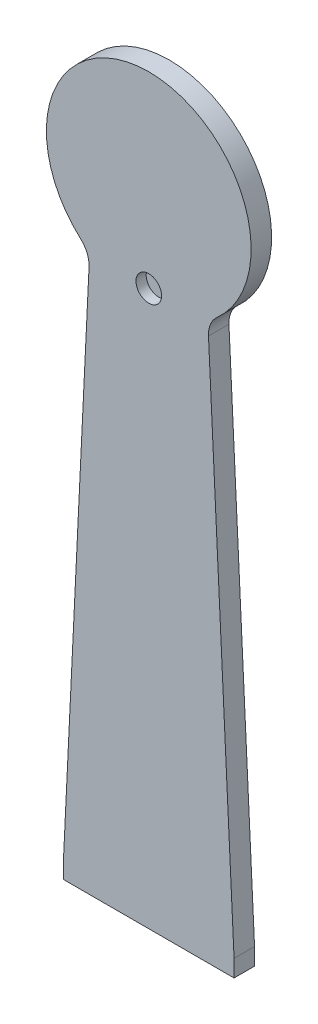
ISO-10303-21;
HEADER;
FILE_DESCRIPTION(('STEP AP214'),'2;1');
FILE_NAME('part.step','',(''),(''),'','','');
FILE_SCHEMA(('AUTOMOTIVE_DESIGN { 1 0 10303 214 1 1 1 1 }'));
ENDSEC;
DATA;
#1=APPLICATION_CONTEXT('core data for automotive mechanical design processes');
#2=APPLICATION_PROTOCOL_DEFINITION('international standard','automotive_design',2000,#1);
#3=PRODUCT_CONTEXT('',#1,'mechanical');
#4=PRODUCT('Part','Part','',(#3));
#5=PRODUCT_RELATED_PRODUCT_CATEGORY('part','',(#4));
#6=PRODUCT_DEFINITION_FORMATION('','',#4);
#7=PRODUCT_DEFINITION_CONTEXT('part definition',#1,'design');
#8=PRODUCT_DEFINITION('design','',#6,#7);
#9=PRODUCT_DEFINITION_SHAPE('','',#8);
#10=(LENGTH_UNIT() NAMED_UNIT(*) SI_UNIT(.MILLI.,.METRE.));
#11=(NAMED_UNIT(*) PLANE_ANGLE_UNIT() SI_UNIT($,.RADIAN.));
#12=(NAMED_UNIT(*) SI_UNIT($,.STERADIAN.) SOLID_ANGLE_UNIT());
#13=UNCERTAINTY_MEASURE_WITH_UNIT(LENGTH_MEASURE(1.E-05),#10,'distance_accuracy_value','');
#14=(GEOMETRIC_REPRESENTATION_CONTEXT(3) GLOBAL_UNCERTAINTY_ASSIGNED_CONTEXT((#13)) GLOBAL_UNIT_ASSIGNED_CONTEXT((#10,
#11,#12)) REPRESENTATION_CONTEXT('',''));
#15=CARTESIAN_POINT('',(0.,0.,0.));
#16=DIRECTION('',(0.,0.,1.));
#17=DIRECTION('',(1.,0.,0.));
#18=AXIS2_PLACEMENT_3D('',#15,#16,#17);
#19=CARTESIAN_POINT('',(-50.,319.074504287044,12.));
#20=DIRECTION('',(0.,0.,-1.));
#21=DIRECTION('',(-1.,0.,0.));
#22=AXIS2_PLACEMENT_3D('',#19,#20,#21);
#23=CYLINDRICAL_SURFACE('',#22,15.017738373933);
#24=CARTESIAN_POINT('',(-50.,319.074504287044,0.));
#25=DIRECTION('',(0.,0.,-1.));
#26=DIRECTION('',(-1.,0.,0.));
#27=AXIS2_PLACEMENT_3D('',#24,#25,#26);
#28=CIRCLE('',#27,15.017738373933);
#29=CARTESIAN_POINT('',(-39.9905417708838,330.270182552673,0.));
#30=VERTEX_POINT('',#29);
#31=CARTESIAN_POINT('',(-35.,318.344801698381,0.));
#32=VERTEX_POINT('',#31);
#33=EDGE_CURVE('E134',#30,#32,#28,.T.);
#34=ORIENTED_EDGE('',*,*,#33,.T.);
#35=DIRECTION('',(0.,0.,-1.));
#36=VECTOR('',#35,1.);
#37=CARTESIAN_POINT('',(-35.,318.344801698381,12.));
#38=LINE('',#37,#36);
#39=CARTESIAN_POINT('',(-35.,318.344801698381,12.));
#40=VERTEX_POINT('',#39);
#41=EDGE_CURVE('E11',#40,#32,#38,.T.);
#42=ORIENTED_EDGE('',*,*,#41,.F.);
#43=CARTESIAN_POINT('',(-50.,319.074504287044,12.));
#44=DIRECTION('',(0.,0.,-1.));
#45=DIRECTION('',(-1.,0.,0.));
#46=AXIS2_PLACEMENT_3D('',#43,#44,#45);
#47=CIRCLE('',#46,15.017738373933);
#48=CARTESIAN_POINT('',(-39.9905417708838,330.270182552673,12.));
#49=VERTEX_POINT('',#48);
#50=EDGE_CURVE('E149',#49,#40,#47,.T.);
#51=ORIENTED_EDGE('',*,*,#50,.F.);
#52=DIRECTION('',(0.,0.,-1.));
#53=VECTOR('',#52,1.);
#54=CARTESIAN_POINT('',(-39.9905417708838,330.270182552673,12.));
#55=LINE('',#54,#53);
#56=EDGE_CURVE('E130',#49,#30,#55,.T.);
#57=ORIENTED_EDGE('',*,*,#56,.T.);
#58=EDGE_LOOP('',(#34,#42,#51,#57));
#59=FACE_BOUND('',#58,.T.);
#60=ADVANCED_FACE('F38',(#59),#23,.F.);
#61=CARTESIAN_POINT('',(-35.,318.344801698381,12.));
#62=DIRECTION('',(0.998818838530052,-0.048589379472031,0.));
#63=DIRECTION('',(0.048589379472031,0.998818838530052,0.));
#64=AXIS2_PLACEMENT_3D('',#61,#62,#63);
#65=PLANE('',#64);
#66=DIRECTION('',(-0.048589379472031,-0.998818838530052,0.));
#67=VECTOR('',#66,1.);
#68=CARTESIAN_POINT('',(-35.,318.344801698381,0.));
#69=LINE('',#68,#67);
#70=CARTESIAN_POINT('',(-50.,10.,0.));
#71=VERTEX_POINT('',#70);
#72=EDGE_CURVE('E137',#32,#71,#69,.T.);
#73=ORIENTED_EDGE('',*,*,#72,.T.);
#74=DIRECTION('',(0.,0.,-1.));
#75=VECTOR('',#74,1.);
#76=CARTESIAN_POINT('',(-50.,10.,12.));
#77=LINE('',#76,#75);
#78=CARTESIAN_POINT('',(-50.,10.,12.));
#79=VERTEX_POINT('',#78);
#80=EDGE_CURVE('E46',#79,#71,#77,.T.);
#81=ORIENTED_EDGE('',*,*,#80,.F.);
#82=DIRECTION('',(-0.048589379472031,-0.998818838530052,0.));
#83=VECTOR('',#82,1.);
#84=CARTESIAN_POINT('',(-35.,318.344801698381,12.));
#85=LINE('',#84,#83);
#86=EDGE_CURVE('E97',#40,#79,#85,.T.);
#87=ORIENTED_EDGE('',*,*,#86,.F.);
#88=ORIENTED_EDGE('',*,*,#41,.T.);
#89=EDGE_LOOP('',(#73,#81,#87,#88));
#90=FACE_BOUND('',#89,.T.);
#91=ADVANCED_FACE('F206',(#90),#65,.F.);
#92=CARTESIAN_POINT('',(-50.,10.,12.));
#93=DIRECTION('',(1.,0.,0.));
#94=DIRECTION('',(0.,0.,-1.));
#95=AXIS2_PLACEMENT_3D('',#92,#93,#94);
#96=PLANE('',#95);
#97=DIRECTION('',(0.,-1.,0.));
#98=VECTOR('',#97,1.);
#99=CARTESIAN_POINT('',(-50.,10.,0.));
#100=LINE('',#99,#98);
#101=CARTESIAN_POINT('',(-50.,0.,0.));
#102=VERTEX_POINT('',#101);
#103=EDGE_CURVE('E140',#71,#102,#100,.T.);
#104=ORIENTED_EDGE('',*,*,#103,.T.);
#105=DIRECTION('',(0.,0.,-1.));
#106=VECTOR('',#105,1.);
#107=CARTESIAN_POINT('',(-50.,0.,12.));
#108=LINE('',#107,#106);
#109=CARTESIAN_POINT('',(-50.,0.,12.));
#110=VERTEX_POINT('',#109);
#111=EDGE_CURVE('E156',#110,#102,#108,.T.);
#112=ORIENTED_EDGE('',*,*,#111,.F.);
#113=DIRECTION('',(0.,-1.,0.));
#114=VECTOR('',#113,1.);
#115=CARTESIAN_POINT('',(-50.,10.,12.));
#116=LINE('',#115,#114);
#117=EDGE_CURVE('E164',#79,#110,#116,.T.);
#118=ORIENTED_EDGE('',*,*,#117,.F.);
#119=ORIENTED_EDGE('',*,*,#80,.T.);
#120=EDGE_LOOP('',(#104,#112,#118,#119));
#121=FACE_BOUND('',#120,.T.);
#122=ADVANCED_FACE('F162',(#121),#96,.F.);
#123=CARTESIAN_POINT('',(-50.,0.,12.));
#124=DIRECTION('',(0.,1.,0.));
#125=DIRECTION('',(0.,0.,1.));
#126=AXIS2_PLACEMENT_3D('',#123,#124,#125);
#127=PLANE('',#126);
#128=DIRECTION('',(1.,0.,0.));
#129=VECTOR('',#128,1.);
#130=CARTESIAN_POINT('',(-50.,0.,0.));
#131=LINE('',#130,#129);
#132=CARTESIAN_POINT('',(50.,0.,0.));
#133=VERTEX_POINT('',#132);
#134=EDGE_CURVE('E142',#102,#133,#131,.T.);
#135=ORIENTED_EDGE('',*,*,#134,.T.);
#136=DIRECTION('',(0.,0.,-1.));
#137=VECTOR('',#136,1.);
#138=CARTESIAN_POINT('',(50.,0.,12.));
#139=LINE('',#138,#137);
#140=CARTESIAN_POINT('',(50.,0.,12.));
#141=VERTEX_POINT('',#140);
#142=EDGE_CURVE('E153',#141,#133,#139,.T.);
#143=ORIENTED_EDGE('',*,*,#142,.F.);
#144=DIRECTION('',(1.,0.,0.));
#145=VECTOR('',#144,1.);
#146=CARTESIAN_POINT('',(-50.,0.,12.));
#147=LINE('',#146,#145);
#148=EDGE_CURVE('E176',#110,#141,#147,.T.);
#149=ORIENTED_EDGE('',*,*,#148,.F.);
#150=ORIENTED_EDGE('',*,*,#111,.T.);
#151=EDGE_LOOP('',(#135,#143,#149,#150));
#152=FACE_BOUND('',#151,.T.);
#153=ADVANCED_FACE('F172',(#152),#127,.F.);
#154=CARTESIAN_POINT('',(50.,10.,12.));
#155=DIRECTION('',(-1.,0.,0.));
#156=DIRECTION('',(0.,0.,1.));
#157=AXIS2_PLACEMENT_3D('',#154,#155,#156);
#158=PLANE('',#157);
#159=DIRECTION('',(0.,1.,0.));
#160=VECTOR('',#159,1.);
#161=CARTESIAN_POINT('',(50.,10.,0.));
#162=LINE('',#161,#160);
#163=CARTESIAN_POINT('',(50.,10.,0.));
#164=VERTEX_POINT('',#163);
#165=EDGE_CURVE('E144',#133,#164,#162,.T.);
#166=ORIENTED_EDGE('',*,*,#165,.T.);
#167=DIRECTION('',(0.,0.,-1.));
#168=VECTOR('',#167,1.);
#169=CARTESIAN_POINT('',(50.,10.,12.));
#170=LINE('',#169,#168);
#171=CARTESIAN_POINT('',(50.,10.,12.));
#172=VERTEX_POINT('',#171);
#173=EDGE_CURVE('E125',#172,#164,#170,.T.);
#174=ORIENTED_EDGE('',*,*,#173,.F.);
#175=DIRECTION('',(0.,1.,0.));
#176=VECTOR('',#175,1.);
#177=CARTESIAN_POINT('',(50.,10.,12.));
#178=LINE('',#177,#176);
#179=EDGE_CURVE('E116',#141,#172,#178,.T.);
#180=ORIENTED_EDGE('',*,*,#179,.F.);
#181=ORIENTED_EDGE('',*,*,#142,.T.);
#182=EDGE_LOOP('',(#166,#174,#180,#181));
#183=FACE_BOUND('',#182,.T.);
#184=ADVANCED_FACE('F175',(#183),#158,.F.);
#185=CARTESIAN_POINT('',(35.,318.344801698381,12.));
#186=DIRECTION('',(-0.998818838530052,-0.048589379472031,0.));
#187=DIRECTION('',(0.048589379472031,-0.998818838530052,0.));
#188=AXIS2_PLACEMENT_3D('',#185,#186,#187);
#189=PLANE('',#188);
#190=DIRECTION('',(-0.048589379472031,0.998818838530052,0.));
#191=VECTOR('',#190,1.);
#192=CARTESIAN_POINT('',(35.,318.344801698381,0.));
#193=LINE('',#192,#191);
#194=CARTESIAN_POINT('',(35.,318.344801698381,0.));
#195=VERTEX_POINT('',#194);
#196=EDGE_CURVE('E124',#164,#195,#193,.T.);
#197=ORIENTED_EDGE('',*,*,#196,.T.);
#198=DIRECTION('',(0.,0.,-1.));
#199=VECTOR('',#198,1.);
#200=CARTESIAN_POINT('',(35.,318.344801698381,12.));
#201=LINE('',#200,#199);
#202=CARTESIAN_POINT('',(35.,318.344801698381,12.));
#203=VERTEX_POINT('',#202);
#204=EDGE_CURVE('E121',#203,#195,#201,.T.);
#205=ORIENTED_EDGE('',*,*,#204,.F.);
#206=DIRECTION('',(-0.048589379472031,0.998818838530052,0.));
#207=VECTOR('',#206,1.);
#208=CARTESIAN_POINT('',(35.,318.344801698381,12.));
#209=LINE('',#208,#207);
#210=EDGE_CURVE('E110',#172,#203,#209,.T.);
#211=ORIENTED_EDGE('',*,*,#210,.F.);
#212=ORIENTED_EDGE('',*,*,#173,.T.);
#213=EDGE_LOOP('',(#197,#205,#211,#212));
#214=FACE_BOUND('',#213,.T.);
#215=ADVANCED_FACE('F122',(#214),#189,.F.);
#216=CARTESIAN_POINT('',(50.,319.074504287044,12.));
#217=DIRECTION('',(0.,0.,-1.));
#218=DIRECTION('',(-1.,0.,0.));
#219=AXIS2_PLACEMENT_3D('',#216,#217,#218);
#220=CYLINDRICAL_SURFACE('',#219,15.017738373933);
#221=CARTESIAN_POINT('',(50.,319.074504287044,0.));
#222=DIRECTION('',(0.,0.,-1.));
#223=DIRECTION('',(1.,0.,0.));
#224=AXIS2_PLACEMENT_3D('',#221,#222,#223);
#225=CIRCLE('',#224,15.017738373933);
#226=CARTESIAN_POINT('',(39.9905417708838,330.270182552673,0.));
#227=VERTEX_POINT('',#226);
#228=EDGE_CURVE('E83',#195,#227,#225,.T.);
#229=ORIENTED_EDGE('',*,*,#228,.T.);
#230=DIRECTION('',(0.,0.,-1.));
#231=VECTOR('',#230,1.);
#232=CARTESIAN_POINT('',(39.9905417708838,330.270182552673,12.));
#233=LINE('',#232,#231);
#234=CARTESIAN_POINT('',(39.9905417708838,330.270182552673,12.));
#235=VERTEX_POINT('',#234);
#236=EDGE_CURVE('E126',#235,#227,#233,.T.);
#237=ORIENTED_EDGE('',*,*,#236,.F.);
#238=CARTESIAN_POINT('',(50.,319.074504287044,12.));
#239=DIRECTION('',(0.,0.,-1.));
#240=DIRECTION('',(1.,0.,0.));
#241=AXIS2_PLACEMENT_3D('',#238,#239,#240);
#242=CIRCLE('',#241,15.017738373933);
#243=EDGE_CURVE('E114',#203,#235,#242,.T.);
#244=ORIENTED_EDGE('',*,*,#243,.F.);
#245=ORIENTED_EDGE('',*,*,#204,.T.);
#246=EDGE_LOOP('',(#229,#237,#244,#245));
#247=FACE_BOUND('',#246,.T.);
#248=ADVANCED_FACE('F128',(#247),#220,.F.);
#249=CARTESIAN_POINT('',(0.,375.,12.));
#250=DIRECTION('',(0.,0.,-1.));
#251=DIRECTION('',(-1.,0.,0.));
#252=AXIS2_PLACEMENT_3D('',#249,#250,#251);
#253=CYLINDRICAL_SURFACE('',#252,60.);
#254=CARTESIAN_POINT('',(0.,375.,0.));
#255=DIRECTION('',(0.,0.,1.));
#256=DIRECTION('',(1.,0.,0.));
#257=AXIS2_PLACEMENT_3D('',#254,#255,#256);
#258=CIRCLE('',#257,60.);
#259=EDGE_CURVE('E89',#227,#30,#258,.T.);
#260=ORIENTED_EDGE('',*,*,#259,.T.);
#261=ORIENTED_EDGE('',*,*,#56,.F.);
#262=CARTESIAN_POINT('',(0.,375.,12.));
#263=DIRECTION('',(0.,0.,1.));
#264=DIRECTION('',(1.,0.,0.));
#265=AXIS2_PLACEMENT_3D('',#262,#263,#264);
#266=CIRCLE('',#265,60.);
#267=EDGE_CURVE('E54',#235,#49,#266,.T.);
#268=ORIENTED_EDGE('',*,*,#267,.F.);
#269=ORIENTED_EDGE('',*,*,#236,.T.);
#270=EDGE_LOOP('',(#260,#261,#268,#269));
#271=FACE_BOUND('',#270,.T.);
#272=ADVANCED_FACE('F197',(#271),#253,.T.);
#273=CARTESIAN_POINT('',(-50.,319.074504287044,12.));
#274=DIRECTION('',(0.,0.,-1.));
#275=DIRECTION('',(-1.,0.,0.));
#276=AXIS2_PLACEMENT_3D('',#273,#274,#275);
#277=PLANE('',#276);
#278=CARTESIAN_POINT('',(0.,325.,12.));
#279=DIRECTION('',(0.,0.,1.));
#280=DIRECTION('',(1.,0.,0.));
#281=AXIS2_PLACEMENT_3D('',#278,#279,#280);
#282=CIRCLE('',#281,7.50000000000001);
#283=CARTESIAN_POINT('',(7.50000000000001,325.,12.));
#284=VERTEX_POINT('',#283);
#285=EDGE_CURVE('E182',#284,#284,#282,.T.);
#286=ORIENTED_EDGE('',*,*,#285,.F.);
#287=EDGE_LOOP('',(#286));
#288=FACE_BOUND('',#287,.T.);
#289=ORIENTED_EDGE('',*,*,#50,.T.);
#290=ORIENTED_EDGE('',*,*,#86,.T.);
#291=ORIENTED_EDGE('',*,*,#117,.T.);
#292=ORIENTED_EDGE('',*,*,#148,.T.);
#293=ORIENTED_EDGE('',*,*,#179,.T.);
#294=ORIENTED_EDGE('',*,*,#210,.T.);
#295=ORIENTED_EDGE('',*,*,#243,.T.);
#296=ORIENTED_EDGE('',*,*,#267,.T.);
#297=EDGE_LOOP('',(#289,#290,#291,#292,#293,#294,#295,#296));
#298=FACE_BOUND('',#297,.T.);
#299=ADVANCED_FACE('F112',(#288,#298),#277,.F.);
#300=CARTESIAN_POINT('',(-50.,319.074504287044,0.));
#301=DIRECTION('',(0.,0.,-1.));
#302=DIRECTION('',(-1.,0.,0.));
#303=AXIS2_PLACEMENT_3D('',#300,#301,#302);
#304=PLANE('',#303);
#305=ORIENTED_EDGE('',*,*,#33,.F.);
#306=ORIENTED_EDGE('',*,*,#259,.F.);
#307=ORIENTED_EDGE('',*,*,#228,.F.);
#308=ORIENTED_EDGE('',*,*,#196,.F.);
#309=ORIENTED_EDGE('',*,*,#165,.F.);
#310=ORIENTED_EDGE('',*,*,#134,.F.);
#311=ORIENTED_EDGE('',*,*,#103,.F.);
#312=ORIENTED_EDGE('',*,*,#72,.F.);
#313=EDGE_LOOP('',(#305,#306,#307,#308,#309,#310,#311,#312));
#314=FACE_BOUND('',#313,.T.);
#315=ADVANCED_FACE('F168',(#314),#304,.T.);
#316=CARTESIAN_POINT('',(0.,325.,6.));
#317=DIRECTION('',(0.,0.,1.));
#318=DIRECTION('',(1.,0.,0.));
#319=AXIS2_PLACEMENT_3D('',#316,#317,#318);
#320=CYLINDRICAL_SURFACE('',#319,7.50000000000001);
#321=CARTESIAN_POINT('',(0.,325.,6.));
#322=DIRECTION('',(0.,0.,1.));
#323=DIRECTION('',(1.,0.,0.));
#324=AXIS2_PLACEMENT_3D('',#321,#322,#323);
#325=CIRCLE('',#324,7.50000000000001);
#326=CARTESIAN_POINT('',(7.50000000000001,325.,6.));
#327=VERTEX_POINT('',#326);
#328=EDGE_CURVE('E138',#327,#327,#325,.T.);
#329=ORIENTED_EDGE('',*,*,#328,.F.);
#330=EDGE_LOOP('',(#329));
#331=FACE_BOUND('',#330,.T.);
#332=ORIENTED_EDGE('',*,*,#285,.T.);
#333=EDGE_LOOP('',(#332));
#334=FACE_BOUND('',#333,.T.);
#335=ADVANCED_FACE('F190',(#331,#334),#320,.F.);
#336=CARTESIAN_POINT('',(0.,325.,6.));
#337=DIRECTION('',(0.,0.,1.));
#338=DIRECTION('',(1.,0.,0.));
#339=AXIS2_PLACEMENT_3D('',#336,#337,#338);
#340=PLANE('',#339);
#341=ORIENTED_EDGE('',*,*,#328,.T.);
#342=EDGE_LOOP('',(#341));
#343=FACE_BOUND('',#342,.T.);
#344=ADVANCED_FACE('F188',(#343),#340,.T.);
#345=CLOSED_SHELL('',(#60,#91,#122,#153,#184,#215,#248,#272,#299,#315,#335,#344));
#346=MANIFOLD_SOLID_BREP('B2',#345);
#347=ADVANCED_BREP_SHAPE_REPRESENTATION('',(#18,#346),#14);
#348=SHAPE_DEFINITION_REPRESENTATION(#9,#347);
ENDSEC;
END-ISO-10303-21;
